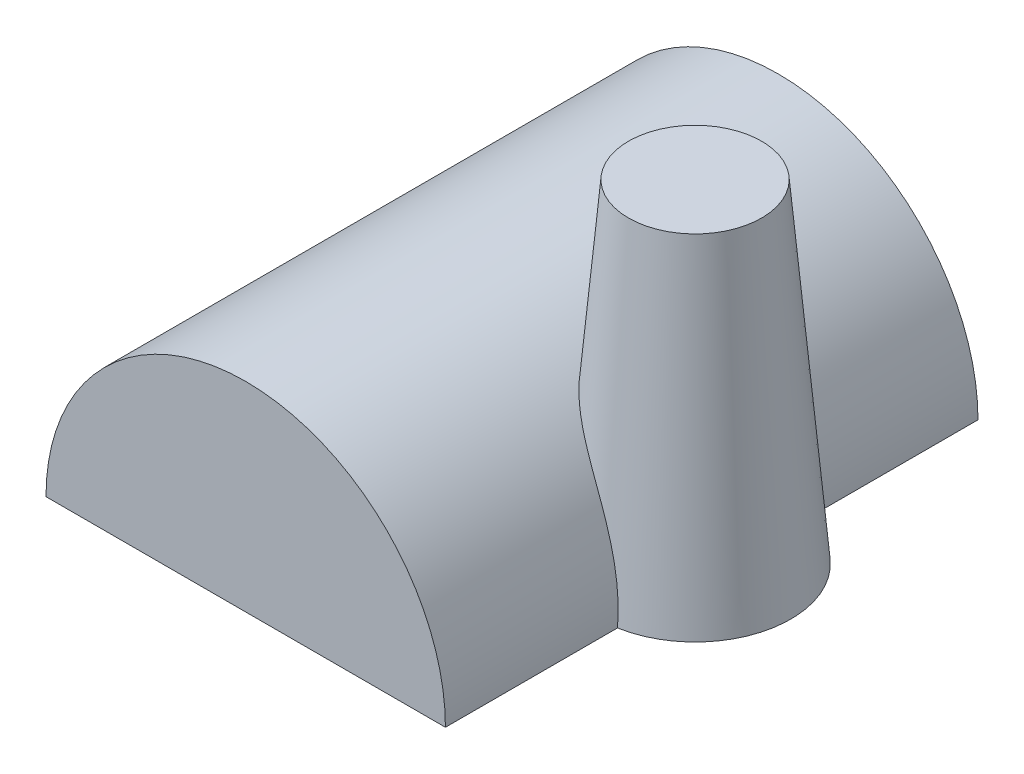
from build123d import *

# Parameters (mm, degrees)
EXTRUDE1_DEPTH = 50.8
SKETCH2_R      = 6.35
EXTRUDE2_DEPTH = 31.75
EXTRUDE2_DRAFT = 5


with BuildPart() as part:
    # Sketch1 → Extrude1 (new body)
    with BuildSketch(Plane.XY):
        with BuildLine():
            Line((-19.05, 0), (19.05, 0))
            ThreePointArc((19.05, 0), (0, 19.05), (-19.05, 0))
        make_face()
    extrude(amount=-EXTRUDE1_DEPTH)


with BuildPart() as extrude2_tool:
    # Sketch2 → Extrude2 (with draft: the straight prism first)
    with BuildSketch(Plane(origin=(0, 31.75, 0), x_dir=(-1, 0, 0), z_dir=(0, 1, 0))):
        with Locations((-17.4625, -25.4)):
            Circle(SKETCH2_R)
    extrude(amount=-EXTRUDE2_DEPTH)
    # Extrude2: the draft: its side faces are tilted about the plane it starts from
    extrude2_sides = [extrude2_tool.faces().sort_by_distance(p)[0] for p in [
        (23.8125, 15.875, -25.4),
    ]]
    draft(extrude2_sides, Plane(origin=(0, 31.75, 0), x_dir=(-1, 0, 0), z_dir=(0, 1, 0)), EXTRUDE2_DRAFT)


with BuildPart() as part_1:
    add(part.part)

    # Extrude2: add extrude2_tool
    add(extrude2_tool.part)


solid = part_1.part
